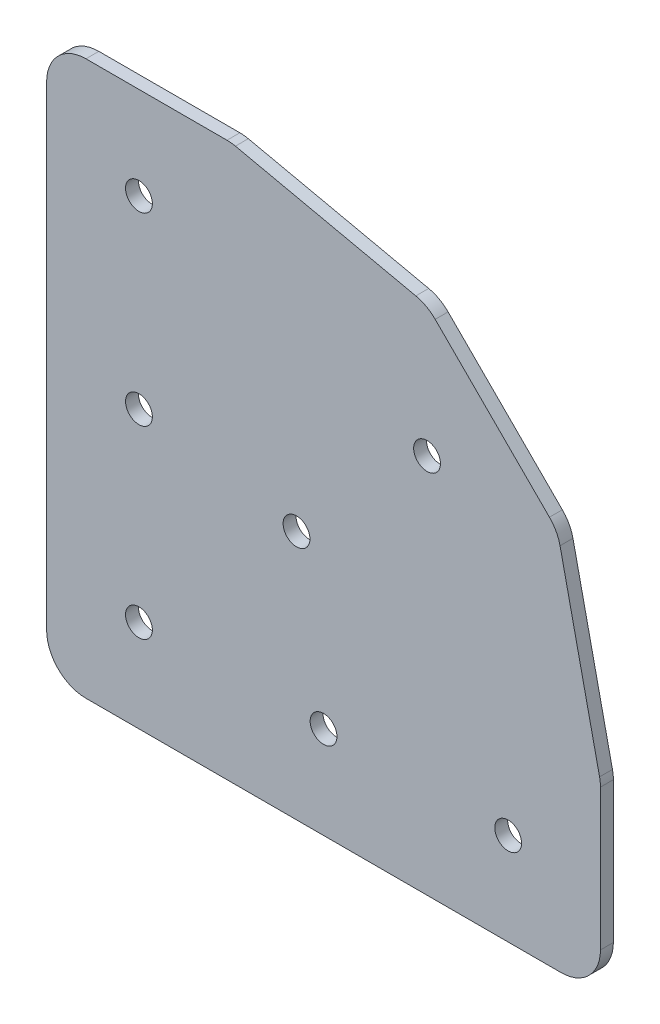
ISO-10303-21;
HEADER;
FILE_DESCRIPTION(('STEP AP214'),'2;1');
FILE_NAME('part.step','',(''),(''),'','','');
FILE_SCHEMA(('AUTOMOTIVE_DESIGN { 1 0 10303 214 1 1 1 1 }'));
ENDSEC;
DATA;
#1=APPLICATION_CONTEXT('core data for automotive mechanical design processes');
#2=APPLICATION_PROTOCOL_DEFINITION('international standard','automotive_design',2000,#1);
#3=PRODUCT_CONTEXT('',#1,'mechanical');
#4=PRODUCT('Part','Part','',(#3));
#5=PRODUCT_RELATED_PRODUCT_CATEGORY('part','',(#4));
#6=PRODUCT_DEFINITION_FORMATION('','',#4);
#7=PRODUCT_DEFINITION_CONTEXT('part definition',#1,'design');
#8=PRODUCT_DEFINITION('design','',#6,#7);
#9=PRODUCT_DEFINITION_SHAPE('','',#8);
#10=(LENGTH_UNIT() NAMED_UNIT(*) SI_UNIT(.MILLI.,.METRE.));
#11=(NAMED_UNIT(*) PLANE_ANGLE_UNIT() SI_UNIT($,.RADIAN.));
#12=(NAMED_UNIT(*) SI_UNIT($,.STERADIAN.) SOLID_ANGLE_UNIT());
#13=UNCERTAINTY_MEASURE_WITH_UNIT(LENGTH_MEASURE(1.E-05),#10,'distance_accuracy_value','');
#14=(GEOMETRIC_REPRESENTATION_CONTEXT(3) GLOBAL_UNCERTAINTY_ASSIGNED_CONTEXT((#13)) GLOBAL_UNIT_ASSIGNED_CONTEXT((#10,
#11,#12)) REPRESENTATION_CONTEXT('',''));
#15=CARTESIAN_POINT('',(0.,0.,0.));
#16=DIRECTION('',(0.,0.,1.));
#17=DIRECTION('',(1.,0.,0.));
#18=AXIS2_PLACEMENT_3D('',#15,#16,#17);
#19=CARTESIAN_POINT('',(0.,0.,1.5875));
#20=DIRECTION('',(0.,0.,1.));
#21=DIRECTION('',(1.,0.,0.));
#22=AXIS2_PLACEMENT_3D('',#19,#20,#21);
#23=PLANE('',#22);
#24=DIRECTION('',(0.,1.,0.));
#25=VECTOR('',#24,1.);
#26=CARTESIAN_POINT('',(0.,68.199,1.5875));
#27=LINE('',#26,#25);
#28=CARTESIAN_POINT('',(0.,63.357125,1.5875));
#29=VERTEX_POINT('',#28);
#30=CARTESIAN_POINT('',(0.,4.841875,1.5875));
#31=VERTEX_POINT('',#30);
#32=EDGE_CURVE('E151',#29,#31,#27,.F.);
#33=ORIENTED_EDGE('',*,*,#32,.T.);
#34=CARTESIAN_POINT('',(4.841875,4.841875,1.5875));
#35=DIRECTION('',(0.,0.,-1.));
#36=DIRECTION('',(-1.,0.,0.));
#37=AXIS2_PLACEMENT_3D('',#34,#35,#36);
#38=CIRCLE('',#37,4.841875);
#39=CARTESIAN_POINT('',(4.841875,0.,1.5875));
#40=VERTEX_POINT('',#39);
#41=EDGE_CURVE('E153',#40,#31,#38,.T.);
#42=ORIENTED_EDGE('',*,*,#41,.F.);
#43=DIRECTION('',(1.,0.,0.));
#44=VECTOR('',#43,1.);
#45=CARTESIAN_POINT('',(0.,0.,1.5875));
#46=LINE('',#45,#44);
#47=CARTESIAN_POINT('',(63.357125,0.,1.5875));
#48=VERTEX_POINT('',#47);
#49=EDGE_CURVE('E146',#40,#48,#46,.T.);
#50=ORIENTED_EDGE('',*,*,#49,.T.);
#51=CARTESIAN_POINT('',(63.357125,4.841875,1.5875));
#52=DIRECTION('',(0.,0.,-1.));
#53=DIRECTION('',(-1.,0.,0.));
#54=AXIS2_PLACEMENT_3D('',#51,#52,#53);
#55=CIRCLE('',#54,4.841875);
#56=CARTESIAN_POINT('',(68.199,4.841875,1.5875));
#57=VERTEX_POINT('',#56);
#58=EDGE_CURVE('E149',#57,#48,#55,.T.);
#59=ORIENTED_EDGE('',*,*,#58,.F.);
#60=DIRECTION('',(0.,1.,0.));
#61=VECTOR('',#60,1.);
#62=CARTESIAN_POINT('',(68.199,22.733,1.5875));
#63=LINE('',#62,#61);
#64=CARTESIAN_POINT('',(68.199,22.2091372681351,1.5875));
#65=VERTEX_POINT('',#64);
#66=EDGE_CURVE('E122',#57,#65,#63,.T.);
#67=ORIENTED_EDGE('',*,*,#66,.T.);
#68=CARTESIAN_POINT('',(63.357125,22.2091372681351,1.5875));
#69=DIRECTION('',(0.,0.,-1.));
#70=DIRECTION('',(-1.,0.,0.));
#71=AXIS2_PLACEMENT_3D('',#68,#69,#70);
#72=CIRCLE('',#71,4.841875);
#73=CARTESIAN_POINT('',(68.0869538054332,23.2447399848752,1.5875));
#74=VERTEX_POINT('',#73);
#75=EDGE_CURVE('E116',#74,#65,#72,.T.);
#76=ORIENTED_EDGE('',*,*,#75,.F.);
#77=DIRECTION('',(0.213884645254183,-0.976858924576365,0.));
#78=VECTOR('',#77,1.);
#79=CARTESIAN_POINT('',(62.9196461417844,46.8449876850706,1.5875));
#80=LINE('',#79,#78);
#81=CARTESIAN_POINT('',(63.2229671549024,45.4596529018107,1.5875));
#82=VERTEX_POINT('',#81);
#83=EDGE_CURVE('E120',#74,#82,#80,.F.);
#84=ORIENTED_EDGE('',*,*,#83,.T.);
#85=CARTESIAN_POINT('',(58.4931383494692,44.4240501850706,1.5875));
#86=DIRECTION('',(0.,0.,-1.));
#87=DIRECTION('',(-1.,0.,0.));
#88=AXIS2_PLACEMENT_3D('',#85,#86,#87);
#89=CIRCLE('',#88,4.841875);
#90=CARTESIAN_POINT('',(61.9168609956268,47.8477728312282,1.5875));
#91=VERTEX_POINT('',#90);
#92=EDGE_CURVE('E135',#91,#82,#89,.T.);
#93=ORIENTED_EDGE('',*,*,#92,.F.);
#94=DIRECTION('',(0.707106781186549,-0.707106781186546,0.));
#95=VECTOR('',#94,1.);
#96=CARTESIAN_POINT('',(62.9196461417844,46.8449876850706,1.5875));
#97=LINE('',#96,#95);
#98=CARTESIAN_POINT('',(47.8477728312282,61.9168609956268,1.5875));
#99=VERTEX_POINT('',#98);
#100=EDGE_CURVE('E165',#91,#99,#97,.F.);
#101=ORIENTED_EDGE('',*,*,#100,.T.);
#102=CARTESIAN_POINT('',(44.4240501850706,58.4931383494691,1.5875));
#103=DIRECTION('',(0.,0.,-1.));
#104=DIRECTION('',(-1.,0.,0.));
#105=AXIS2_PLACEMENT_3D('',#102,#103,#104);
#106=CIRCLE('',#105,4.841875);
#107=CARTESIAN_POINT('',(45.4596529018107,63.2229671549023,1.5875));
#108=VERTEX_POINT('',#107);
#109=EDGE_CURVE('E167',#108,#99,#106,.T.);
#110=ORIENTED_EDGE('',*,*,#109,.F.);
#111=DIRECTION('',(0.976858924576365,-0.213884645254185,0.));
#112=VECTOR('',#111,1.);
#113=CARTESIAN_POINT('',(46.8449876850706,62.9196461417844,1.5875));
#114=LINE('',#113,#112);
#115=CARTESIAN_POINT('',(23.2447399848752,68.0869538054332,1.5875));
#116=VERTEX_POINT('',#115);
#117=EDGE_CURVE('E160',#108,#116,#114,.F.);
#118=ORIENTED_EDGE('',*,*,#117,.T.);
#119=CARTESIAN_POINT('',(22.2091372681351,63.357125,1.5875));
#120=DIRECTION('',(0.,0.,-1.));
#121=DIRECTION('',(-1.,0.,0.));
#122=AXIS2_PLACEMENT_3D('',#119,#120,#121);
#123=CIRCLE('',#122,4.841875);
#124=CARTESIAN_POINT('',(22.2091372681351,68.199,1.5875));
#125=VERTEX_POINT('',#124);
#126=EDGE_CURVE('E163',#125,#116,#123,.T.);
#127=ORIENTED_EDGE('',*,*,#126,.F.);
#128=DIRECTION('',(1.,0.,0.));
#129=VECTOR('',#128,1.);
#130=CARTESIAN_POINT('',(22.733,68.199,1.5875));
#131=LINE('',#130,#129);
#132=CARTESIAN_POINT('',(4.841875,68.199,1.5875));
#133=VERTEX_POINT('',#132);
#134=EDGE_CURVE('E155',#125,#133,#131,.F.);
#135=ORIENTED_EDGE('',*,*,#134,.T.);
#136=CARTESIAN_POINT('',(4.841875,63.357125,1.5875));
#137=DIRECTION('',(0.,0.,-1.));
#138=DIRECTION('',(-1.,0.,0.));
#139=AXIS2_PLACEMENT_3D('',#136,#137,#138);
#140=CIRCLE('',#139,4.841875);
#141=EDGE_CURVE('E158',#29,#133,#140,.T.);
#142=ORIENTED_EDGE('',*,*,#141,.F.);
#143=EDGE_LOOP('',(#33,#42,#50,#59,#67,#76,#84,#93,#101,#110,#118,#127,#135,#142));
#144=FACE_BOUND('',#143,.T.);
#145=CARTESIAN_POINT('',(11.3665,56.8325,1.5875));
#146=DIRECTION('',(0.,0.,1.));
#147=DIRECTION('',(1.,0.,0.));
#148=AXIS2_PLACEMENT_3D('',#145,#146,#147);
#149=CIRCLE('',#148,1.651);
#150=CARTESIAN_POINT('',(13.0175,56.8325,1.5875));
#151=VERTEX_POINT('',#150);
#152=EDGE_CURVE('E128',#151,#151,#149,.F.);
#153=ORIENTED_EDGE('',*,*,#152,.T.);
#154=EDGE_LOOP('',(#153));
#155=FACE_BOUND('',#154,.T.);
#156=CARTESIAN_POINT('',(11.3665,34.0995,1.5875));
#157=DIRECTION('',(0.,0.,1.));
#158=DIRECTION('',(1.,0.,0.));
#159=AXIS2_PLACEMENT_3D('',#156,#157,#158);
#160=CIRCLE('',#159,1.651);
#161=CARTESIAN_POINT('',(13.0175,34.0995,1.5875));
#162=VERTEX_POINT('',#161);
#163=EDGE_CURVE('E227',#162,#162,#160,.F.);
#164=ORIENTED_EDGE('',*,*,#163,.T.);
#165=EDGE_LOOP('',(#164));
#166=FACE_BOUND('',#165,.T.);
#167=CARTESIAN_POINT('',(11.3665,11.3665,1.5875));
#168=DIRECTION('',(0.,0.,1.));
#169=DIRECTION('',(1.,0.,0.));
#170=AXIS2_PLACEMENT_3D('',#167,#168,#169);
#171=CIRCLE('',#170,1.651);
#172=CARTESIAN_POINT('',(13.0175,11.3665,1.5875));
#173=VERTEX_POINT('',#172);
#174=EDGE_CURVE('E230',#173,#173,#171,.F.);
#175=ORIENTED_EDGE('',*,*,#174,.T.);
#176=EDGE_LOOP('',(#175));
#177=FACE_BOUND('',#176,.T.);
#178=CARTESIAN_POINT('',(56.8325,11.3665,1.5875));
#179=DIRECTION('',(0.,0.,1.));
#180=DIRECTION('',(1.,0.,0.));
#181=AXIS2_PLACEMENT_3D('',#178,#179,#180);
#182=CIRCLE('',#181,1.651);
#183=CARTESIAN_POINT('',(58.4835,11.3665,1.5875));
#184=VERTEX_POINT('',#183);
#185=EDGE_CURVE('E233',#184,#184,#182,.F.);
#186=ORIENTED_EDGE('',*,*,#185,.T.);
#187=EDGE_LOOP('',(#186));
#188=FACE_BOUND('',#187,.T.);
#189=CARTESIAN_POINT('',(30.7703292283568,30.7703292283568,1.5875));
#190=DIRECTION('',(0.,0.,1.));
#191=DIRECTION('',(1.,0.,0.));
#192=AXIS2_PLACEMENT_3D('',#189,#190,#191);
#193=CIRCLE('',#192,1.651);
#194=CARTESIAN_POINT('',(32.4213292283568,30.7703292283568,1.5875));
#195=VERTEX_POINT('',#194);
#196=EDGE_CURVE('E236',#195,#195,#193,.F.);
#197=ORIENTED_EDGE('',*,*,#196,.T.);
#198=EDGE_LOOP('',(#197));
#199=FACE_BOUND('',#198,.T.);
#200=CARTESIAN_POINT('',(46.8449876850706,46.8449876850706,1.5875));
#201=DIRECTION('',(0.,0.,1.));
#202=DIRECTION('',(1.,0.,0.));
#203=AXIS2_PLACEMENT_3D('',#200,#201,#202);
#204=CIRCLE('',#203,1.651);
#205=CARTESIAN_POINT('',(48.4959876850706,46.8449876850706,1.5875));
#206=VERTEX_POINT('',#205);
#207=EDGE_CURVE('E238',#206,#206,#204,.F.);
#208=ORIENTED_EDGE('',*,*,#207,.T.);
#209=EDGE_LOOP('',(#208));
#210=FACE_BOUND('',#209,.T.);
#211=CARTESIAN_POINT('',(34.0995,11.3665,1.5875));
#212=DIRECTION('',(0.,0.,1.));
#213=DIRECTION('',(1.,0.,0.));
#214=AXIS2_PLACEMENT_3D('',#211,#212,#213);
#215=CIRCLE('',#214,1.651);
#216=CARTESIAN_POINT('',(35.7505,11.3665,1.5875));
#217=VERTEX_POINT('',#216);
#218=EDGE_CURVE('E20',#217,#217,#215,.F.);
#219=ORIENTED_EDGE('',*,*,#218,.T.);
#220=EDGE_LOOP('',(#219));
#221=FACE_BOUND('',#220,.T.);
#222=ADVANCED_FACE('F17',(#144,#155,#166,#177,#188,#199,#210,#221),#23,.T.);
#223=CARTESIAN_POINT('',(34.0995,11.3665,1.5875));
#224=DIRECTION('',(0.,0.,1.));
#225=DIRECTION('',(1.,0.,0.));
#226=AXIS2_PLACEMENT_3D('',#223,#224,#225);
#227=CYLINDRICAL_SURFACE('',#226,1.651);
#228=CARTESIAN_POINT('',(34.0995,11.3665,0.));
#229=DIRECTION('',(0.,0.,1.));
#230=DIRECTION('',(1.,0.,0.));
#231=AXIS2_PLACEMENT_3D('',#228,#229,#230);
#232=CIRCLE('',#231,1.651);
#233=CARTESIAN_POINT('',(35.7505,11.3665,0.));
#234=VERTEX_POINT('',#233);
#235=EDGE_CURVE('E145',#234,#234,#232,.F.);
#236=ORIENTED_EDGE('',*,*,#235,.T.);
#237=EDGE_LOOP('',(#236));
#238=FACE_BOUND('',#237,.T.);
#239=ORIENTED_EDGE('',*,*,#218,.F.);
#240=EDGE_LOOP('',(#239));
#241=FACE_BOUND('',#240,.T.);
#242=ADVANCED_FACE('F246',(#238,#241),#227,.F.);
#243=CARTESIAN_POINT('',(46.8449876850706,46.8449876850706,1.5875));
#244=DIRECTION('',(0.,0.,1.));
#245=DIRECTION('',(1.,0.,0.));
#246=AXIS2_PLACEMENT_3D('',#243,#244,#245);
#247=CYLINDRICAL_SURFACE('',#246,1.651);
#248=CARTESIAN_POINT('',(46.8449876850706,46.8449876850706,0.));
#249=DIRECTION('',(0.,0.,1.));
#250=DIRECTION('',(1.,0.,0.));
#251=AXIS2_PLACEMENT_3D('',#248,#249,#250);
#252=CIRCLE('',#251,1.651);
#253=CARTESIAN_POINT('',(48.4959876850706,46.8449876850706,0.));
#254=VERTEX_POINT('',#253);
#255=EDGE_CURVE('E209',#254,#254,#252,.F.);
#256=ORIENTED_EDGE('',*,*,#255,.T.);
#257=EDGE_LOOP('',(#256));
#258=FACE_BOUND('',#257,.T.);
#259=ORIENTED_EDGE('',*,*,#207,.F.);
#260=EDGE_LOOP('',(#259));
#261=FACE_BOUND('',#260,.T.);
#262=ADVANCED_FACE('F248',(#258,#261),#247,.F.);
#263=CARTESIAN_POINT('',(30.7703292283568,30.7703292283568,1.5875));
#264=DIRECTION('',(0.,0.,1.));
#265=DIRECTION('',(1.,0.,0.));
#266=AXIS2_PLACEMENT_3D('',#263,#264,#265);
#267=CYLINDRICAL_SURFACE('',#266,1.651);
#268=CARTESIAN_POINT('',(30.7703292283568,30.7703292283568,0.));
#269=DIRECTION('',(0.,0.,1.));
#270=DIRECTION('',(1.,0.,0.));
#271=AXIS2_PLACEMENT_3D('',#268,#269,#270);
#272=CIRCLE('',#271,1.651);
#273=CARTESIAN_POINT('',(32.4213292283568,30.7703292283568,0.));
#274=VERTEX_POINT('',#273);
#275=EDGE_CURVE('E206',#274,#274,#272,.F.);
#276=ORIENTED_EDGE('',*,*,#275,.T.);
#277=EDGE_LOOP('',(#276));
#278=FACE_BOUND('',#277,.T.);
#279=ORIENTED_EDGE('',*,*,#196,.F.);
#280=EDGE_LOOP('',(#279));
#281=FACE_BOUND('',#280,.T.);
#282=ADVANCED_FACE('F255',(#278,#281),#267,.F.);
#283=CARTESIAN_POINT('',(56.8325,11.3665,1.5875));
#284=DIRECTION('',(0.,0.,1.));
#285=DIRECTION('',(1.,0.,0.));
#286=AXIS2_PLACEMENT_3D('',#283,#284,#285);
#287=CYLINDRICAL_SURFACE('',#286,1.651);
#288=CARTESIAN_POINT('',(56.8325,11.3665,0.));
#289=DIRECTION('',(0.,0.,1.));
#290=DIRECTION('',(1.,0.,0.));
#291=AXIS2_PLACEMENT_3D('',#288,#289,#290);
#292=CIRCLE('',#291,1.651);
#293=CARTESIAN_POINT('',(58.4835,11.3665,0.));
#294=VERTEX_POINT('',#293);
#295=EDGE_CURVE('E203',#294,#294,#292,.F.);
#296=ORIENTED_EDGE('',*,*,#295,.T.);
#297=EDGE_LOOP('',(#296));
#298=FACE_BOUND('',#297,.T.);
#299=ORIENTED_EDGE('',*,*,#185,.F.);
#300=EDGE_LOOP('',(#299));
#301=FACE_BOUND('',#300,.T.);
#302=ADVANCED_FACE('F329',(#298,#301),#287,.F.);
#303=CARTESIAN_POINT('',(11.3665,11.3665,1.5875));
#304=DIRECTION('',(0.,0.,1.));
#305=DIRECTION('',(1.,0.,0.));
#306=AXIS2_PLACEMENT_3D('',#303,#304,#305);
#307=CYLINDRICAL_SURFACE('',#306,1.651);
#308=CARTESIAN_POINT('',(11.3665,11.3665,0.));
#309=DIRECTION('',(0.,0.,1.));
#310=DIRECTION('',(1.,0.,0.));
#311=AXIS2_PLACEMENT_3D('',#308,#309,#310);
#312=CIRCLE('',#311,1.651);
#313=CARTESIAN_POINT('',(13.0175,11.3665,0.));
#314=VERTEX_POINT('',#313);
#315=EDGE_CURVE('E200',#314,#314,#312,.F.);
#316=ORIENTED_EDGE('',*,*,#315,.T.);
#317=EDGE_LOOP('',(#316));
#318=FACE_BOUND('',#317,.T.);
#319=ORIENTED_EDGE('',*,*,#174,.F.);
#320=EDGE_LOOP('',(#319));
#321=FACE_BOUND('',#320,.T.);
#322=ADVANCED_FACE('F325',(#318,#321),#307,.F.);
#323=CARTESIAN_POINT('',(11.3665,34.0995,1.5875));
#324=DIRECTION('',(0.,0.,1.));
#325=DIRECTION('',(1.,0.,0.));
#326=AXIS2_PLACEMENT_3D('',#323,#324,#325);
#327=CYLINDRICAL_SURFACE('',#326,1.651);
#328=CARTESIAN_POINT('',(11.3665,34.0995,0.));
#329=DIRECTION('',(0.,0.,1.));
#330=DIRECTION('',(1.,0.,0.));
#331=AXIS2_PLACEMENT_3D('',#328,#329,#330);
#332=CIRCLE('',#331,1.651);
#333=CARTESIAN_POINT('',(13.0175,34.0995,0.));
#334=VERTEX_POINT('',#333);
#335=EDGE_CURVE('E197',#334,#334,#332,.F.);
#336=ORIENTED_EDGE('',*,*,#335,.T.);
#337=EDGE_LOOP('',(#336));
#338=FACE_BOUND('',#337,.T.);
#339=ORIENTED_EDGE('',*,*,#163,.F.);
#340=EDGE_LOOP('',(#339));
#341=FACE_BOUND('',#340,.T.);
#342=ADVANCED_FACE('F321',(#338,#341),#327,.F.);
#343=CARTESIAN_POINT('',(11.3665,56.8325,1.5875));
#344=DIRECTION('',(0.,0.,1.));
#345=DIRECTION('',(1.,0.,0.));
#346=AXIS2_PLACEMENT_3D('',#343,#344,#345);
#347=CYLINDRICAL_SURFACE('',#346,1.651);
#348=CARTESIAN_POINT('',(11.3665,56.8325,0.));
#349=DIRECTION('',(0.,0.,1.));
#350=DIRECTION('',(1.,0.,0.));
#351=AXIS2_PLACEMENT_3D('',#348,#349,#350);
#352=CIRCLE('',#351,1.651);
#353=CARTESIAN_POINT('',(13.0175,56.8325,0.));
#354=VERTEX_POINT('',#353);
#355=EDGE_CURVE('E194',#354,#354,#352,.F.);
#356=ORIENTED_EDGE('',*,*,#355,.T.);
#357=EDGE_LOOP('',(#356));
#358=FACE_BOUND('',#357,.T.);
#359=ORIENTED_EDGE('',*,*,#152,.F.);
#360=EDGE_LOOP('',(#359));
#361=FACE_BOUND('',#360,.T.);
#362=ADVANCED_FACE('F318',(#358,#361),#347,.F.);
#363=CARTESIAN_POINT('',(63.357125,22.2091372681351,1.5875));
#364=DIRECTION('',(0.,0.,-1.));
#365=DIRECTION('',(-1.,0.,0.));
#366=AXIS2_PLACEMENT_3D('',#363,#364,#365);
#367=CYLINDRICAL_SURFACE('',#366,4.841875);
#368=CARTESIAN_POINT('',(63.357125,22.2091372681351,0.));
#369=DIRECTION('',(0.,0.,-1.));
#370=DIRECTION('',(-1.,0.,0.));
#371=AXIS2_PLACEMENT_3D('',#368,#369,#370);
#372=CIRCLE('',#371,4.841875);
#373=CARTESIAN_POINT('',(68.199,22.2091372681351,0.));
#374=VERTEX_POINT('',#373);
#375=CARTESIAN_POINT('',(68.0869538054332,23.2447399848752,0.));
#376=VERTEX_POINT('',#375);
#377=EDGE_CURVE('E139',#374,#376,#372,.F.);
#378=ORIENTED_EDGE('',*,*,#377,.T.);
#379=DIRECTION('',(0.,0.,1.));
#380=VECTOR('',#379,1.);
#381=CARTESIAN_POINT('',(68.0869538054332,23.2447399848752,1.5875));
#382=LINE('',#381,#380);
#383=EDGE_CURVE('E127',#376,#74,#382,.T.);
#384=ORIENTED_EDGE('',*,*,#383,.T.);
#385=ORIENTED_EDGE('',*,*,#75,.T.);
#386=DIRECTION('',(0.,0.,1.));
#387=VECTOR('',#386,1.);
#388=CARTESIAN_POINT('',(68.199,22.2091372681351,1.5875));
#389=LINE('',#388,#387);
#390=EDGE_CURVE('E525',#65,#374,#389,.F.);
#391=ORIENTED_EDGE('',*,*,#390,.T.);
#392=EDGE_LOOP('',(#378,#384,#385,#391));
#393=FACE_BOUND('',#392,.T.);
#394=ADVANCED_FACE('F138',(#393),#367,.T.);
#395=CARTESIAN_POINT('',(62.9196461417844,46.8449876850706,1.5875));
#396=DIRECTION('',(-0.976858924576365,-0.213884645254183,0.));
#397=DIRECTION('',(0.213884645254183,-0.976858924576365,0.));
#398=AXIS2_PLACEMENT_3D('',#395,#396,#397);
#399=PLANE('',#398);
#400=ORIENTED_EDGE('',*,*,#383,.F.);
#401=DIRECTION('',(-0.213884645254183,0.976858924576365,0.));
#402=VECTOR('',#401,1.);
#403=CARTESIAN_POINT('',(68.0869538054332,23.2447399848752,0.));
#404=LINE('',#403,#402);
#405=CARTESIAN_POINT('',(63.2229671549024,45.4596529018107,0.));
#406=VERTEX_POINT('',#405);
#407=EDGE_CURVE('E192',#376,#406,#404,.T.);
#408=ORIENTED_EDGE('',*,*,#407,.T.);
#409=DIRECTION('',(0.,0.,-1.));
#410=VECTOR('',#409,1.);
#411=CARTESIAN_POINT('',(63.2229671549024,45.4596529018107,1.5875));
#412=LINE('',#411,#410);
#413=EDGE_CURVE('E134',#82,#406,#412,.T.);
#414=ORIENTED_EDGE('',*,*,#413,.F.);
#415=ORIENTED_EDGE('',*,*,#83,.F.);
#416=EDGE_LOOP('',(#400,#408,#414,#415));
#417=FACE_BOUND('',#416,.T.);
#418=ADVANCED_FACE('F131',(#417),#399,.F.);
#419=CARTESIAN_POINT('',(58.4931383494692,44.4240501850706,1.5875));
#420=DIRECTION('',(0.,0.,-1.));
#421=DIRECTION('',(-1.,0.,0.));
#422=AXIS2_PLACEMENT_3D('',#419,#420,#421);
#423=CYLINDRICAL_SURFACE('',#422,4.841875);
#424=CARTESIAN_POINT('',(58.4931383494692,44.4240501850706,0.));
#425=DIRECTION('',(0.,0.,-1.));
#426=DIRECTION('',(-1.,0.,0.));
#427=AXIS2_PLACEMENT_3D('',#424,#425,#426);
#428=CIRCLE('',#427,4.841875);
#429=CARTESIAN_POINT('',(61.9168609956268,47.8477728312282,0.));
#430=VERTEX_POINT('',#429);
#431=EDGE_CURVE('E189',#406,#430,#428,.F.);
#432=ORIENTED_EDGE('',*,*,#431,.T.);
#433=DIRECTION('',(0.,0.,1.));
#434=VECTOR('',#433,1.);
#435=CARTESIAN_POINT('',(61.9168609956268,47.8477728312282,1.5875));
#436=LINE('',#435,#434);
#437=EDGE_CURVE('E168',#430,#91,#436,.T.);
#438=ORIENTED_EDGE('',*,*,#437,.T.);
#439=ORIENTED_EDGE('',*,*,#92,.T.);
#440=ORIENTED_EDGE('',*,*,#413,.T.);
#441=EDGE_LOOP('',(#432,#438,#439,#440));
#442=FACE_BOUND('',#441,.T.);
#443=ADVANCED_FACE('F309',(#442),#423,.T.);
#444=CARTESIAN_POINT('',(62.9196461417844,46.8449876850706,1.5875));
#445=DIRECTION('',(-0.707106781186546,-0.707106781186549,0.));
#446=DIRECTION('',(0.707106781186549,-0.707106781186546,0.));
#447=AXIS2_PLACEMENT_3D('',#444,#445,#446);
#448=PLANE('',#447);
#449=ORIENTED_EDGE('',*,*,#437,.F.);
#450=DIRECTION('',(-0.707106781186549,0.707106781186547,0.));
#451=VECTOR('',#450,1.);
#452=CARTESIAN_POINT('',(61.9168609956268,47.8477728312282,0.));
#453=LINE('',#452,#451);
#454=CARTESIAN_POINT('',(47.8477728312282,61.9168609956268,0.));
#455=VERTEX_POINT('',#454);
#456=EDGE_CURVE('E188',#430,#455,#453,.T.);
#457=ORIENTED_EDGE('',*,*,#456,.T.);
#458=DIRECTION('',(0.,0.,-1.));
#459=VECTOR('',#458,1.);
#460=CARTESIAN_POINT('',(47.8477728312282,61.9168609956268,1.5875));
#461=LINE('',#460,#459);
#462=EDGE_CURVE('E223',#99,#455,#461,.T.);
#463=ORIENTED_EDGE('',*,*,#462,.F.);
#464=ORIENTED_EDGE('',*,*,#100,.F.);
#465=EDGE_LOOP('',(#449,#457,#463,#464));
#466=FACE_BOUND('',#465,.T.);
#467=ADVANCED_FACE('F305',(#466),#448,.F.);
#468=CARTESIAN_POINT('',(44.4240501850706,58.4931383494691,1.5875));
#469=DIRECTION('',(0.,0.,-1.));
#470=DIRECTION('',(-1.,0.,0.));
#471=AXIS2_PLACEMENT_3D('',#468,#469,#470);
#472=CYLINDRICAL_SURFACE('',#471,4.841875);
#473=CARTESIAN_POINT('',(44.4240501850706,58.4931383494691,0.));
#474=DIRECTION('',(0.,0.,-1.));
#475=DIRECTION('',(-1.,0.,0.));
#476=AXIS2_PLACEMENT_3D('',#473,#474,#475);
#477=CIRCLE('',#476,4.841875);
#478=CARTESIAN_POINT('',(45.4596529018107,63.2229671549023,0.));
#479=VERTEX_POINT('',#478);
#480=EDGE_CURVE('E185',#455,#479,#477,.F.);
#481=ORIENTED_EDGE('',*,*,#480,.T.);
#482=DIRECTION('',(0.,0.,1.));
#483=VECTOR('',#482,1.);
#484=CARTESIAN_POINT('',(45.4596529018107,63.2229671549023,1.5875));
#485=LINE('',#484,#483);
#486=EDGE_CURVE('E164',#479,#108,#485,.T.);
#487=ORIENTED_EDGE('',*,*,#486,.T.);
#488=ORIENTED_EDGE('',*,*,#109,.T.);
#489=ORIENTED_EDGE('',*,*,#462,.T.);
#490=EDGE_LOOP('',(#481,#487,#488,#489));
#491=FACE_BOUND('',#490,.T.);
#492=ADVANCED_FACE('F301',(#491),#472,.T.);
#493=CARTESIAN_POINT('',(46.8449876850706,62.9196461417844,1.5875));
#494=DIRECTION('',(-0.213884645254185,-0.976858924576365,0.));
#495=DIRECTION('',(0.976858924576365,-0.213884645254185,0.));
#496=AXIS2_PLACEMENT_3D('',#493,#494,#495);
#497=PLANE('',#496);
#498=ORIENTED_EDGE('',*,*,#486,.F.);
#499=DIRECTION('',(-0.976858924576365,0.213884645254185,0.));
#500=VECTOR('',#499,1.);
#501=CARTESIAN_POINT('',(45.4596529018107,63.2229671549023,0.));
#502=LINE('',#501,#500);
#503=CARTESIAN_POINT('',(23.2447399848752,68.0869538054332,0.));
#504=VERTEX_POINT('',#503);
#505=EDGE_CURVE('E184',#479,#504,#502,.T.);
#506=ORIENTED_EDGE('',*,*,#505,.T.);
#507=DIRECTION('',(0.,0.,-1.));
#508=VECTOR('',#507,1.);
#509=CARTESIAN_POINT('',(23.2447399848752,68.0869538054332,1.5875));
#510=LINE('',#509,#508);
#511=EDGE_CURVE('E221',#116,#504,#510,.T.);
#512=ORIENTED_EDGE('',*,*,#511,.F.);
#513=ORIENTED_EDGE('',*,*,#117,.F.);
#514=EDGE_LOOP('',(#498,#506,#512,#513));
#515=FACE_BOUND('',#514,.T.);
#516=ADVANCED_FACE('F297',(#515),#497,.F.);
#517=CARTESIAN_POINT('',(22.2091372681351,63.357125,1.5875));
#518=DIRECTION('',(0.,0.,-1.));
#519=DIRECTION('',(-1.,0.,0.));
#520=AXIS2_PLACEMENT_3D('',#517,#518,#519);
#521=CYLINDRICAL_SURFACE('',#520,4.841875);
#522=CARTESIAN_POINT('',(22.2091372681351,63.357125,0.));
#523=DIRECTION('',(0.,0.,-1.));
#524=DIRECTION('',(-1.,0.,0.));
#525=AXIS2_PLACEMENT_3D('',#522,#523,#524);
#526=CIRCLE('',#525,4.841875);
#527=CARTESIAN_POINT('',(22.2091372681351,68.199,0.));
#528=VERTEX_POINT('',#527);
#529=EDGE_CURVE('E181',#504,#528,#526,.F.);
#530=ORIENTED_EDGE('',*,*,#529,.T.);
#531=DIRECTION('',(0.,0.,-1.));
#532=VECTOR('',#531,1.);
#533=CARTESIAN_POINT('',(22.2091372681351,68.199,1.5875));
#534=LINE('',#533,#532);
#535=EDGE_CURVE('E159',#528,#125,#534,.F.);
#536=ORIENTED_EDGE('',*,*,#535,.T.);
#537=ORIENTED_EDGE('',*,*,#126,.T.);
#538=ORIENTED_EDGE('',*,*,#511,.T.);
#539=EDGE_LOOP('',(#530,#536,#537,#538));
#540=FACE_BOUND('',#539,.T.);
#541=ADVANCED_FACE('F293',(#540),#521,.T.);
#542=CARTESIAN_POINT('',(22.733,68.199,1.5875));
#543=DIRECTION('',(0.,-1.,0.));
#544=DIRECTION('',(0.,0.,-1.));
#545=AXIS2_PLACEMENT_3D('',#542,#543,#544);
#546=PLANE('',#545);
#547=ORIENTED_EDGE('',*,*,#535,.F.);
#548=DIRECTION('',(1.,0.,0.));
#549=VECTOR('',#548,1.);
#550=CARTESIAN_POINT('',(0.,68.199,0.));
#551=LINE('',#550,#549);
#552=CARTESIAN_POINT('',(4.841875,68.199,0.));
#553=VERTEX_POINT('',#552);
#554=EDGE_CURVE('E180',#528,#553,#551,.F.);
#555=ORIENTED_EDGE('',*,*,#554,.T.);
#556=DIRECTION('',(0.,0.,-1.));
#557=VECTOR('',#556,1.);
#558=CARTESIAN_POINT('',(4.841875,68.199,1.5875));
#559=LINE('',#558,#557);
#560=EDGE_CURVE('E219',#133,#553,#559,.T.);
#561=ORIENTED_EDGE('',*,*,#560,.F.);
#562=ORIENTED_EDGE('',*,*,#134,.F.);
#563=EDGE_LOOP('',(#547,#555,#561,#562));
#564=FACE_BOUND('',#563,.T.);
#565=ADVANCED_FACE('F289',(#564),#546,.F.);
#566=CARTESIAN_POINT('',(4.841875,63.357125,1.5875));
#567=DIRECTION('',(0.,0.,-1.));
#568=DIRECTION('',(-1.,0.,0.));
#569=AXIS2_PLACEMENT_3D('',#566,#567,#568);
#570=CYLINDRICAL_SURFACE('',#569,4.841875);
#571=CARTESIAN_POINT('',(4.841875,63.357125,0.));
#572=DIRECTION('',(0.,0.,-1.));
#573=DIRECTION('',(-1.,0.,0.));
#574=AXIS2_PLACEMENT_3D('',#571,#572,#573);
#575=CIRCLE('',#574,4.841875);
#576=CARTESIAN_POINT('',(0.,63.357125,0.));
#577=VERTEX_POINT('',#576);
#578=EDGE_CURVE('E177',#553,#577,#575,.F.);
#579=ORIENTED_EDGE('',*,*,#578,.T.);
#580=DIRECTION('',(0.,0.,-1.));
#581=VECTOR('',#580,1.);
#582=CARTESIAN_POINT('',(0.,63.357125,1.5875));
#583=LINE('',#582,#581);
#584=EDGE_CURVE('E154',#577,#29,#583,.F.);
#585=ORIENTED_EDGE('',*,*,#584,.T.);
#586=ORIENTED_EDGE('',*,*,#141,.T.);
#587=ORIENTED_EDGE('',*,*,#560,.T.);
#588=EDGE_LOOP('',(#579,#585,#586,#587));
#589=FACE_BOUND('',#588,.T.);
#590=ADVANCED_FACE('F285',(#589),#570,.T.);
#591=CARTESIAN_POINT('',(0.,68.199,1.5875));
#592=DIRECTION('',(1.,0.,0.));
#593=DIRECTION('',(0.,0.,-1.));
#594=AXIS2_PLACEMENT_3D('',#591,#592,#593);
#595=PLANE('',#594);
#596=DIRECTION('',(0.,0.,-1.));
#597=VECTOR('',#596,1.);
#598=CARTESIAN_POINT('',(0.,4.841875,1.5875));
#599=LINE('',#598,#597);
#600=CARTESIAN_POINT('',(0.,4.841875,0.));
#601=VERTEX_POINT('',#600);
#602=EDGE_CURVE('E217',#31,#601,#599,.T.);
#603=ORIENTED_EDGE('',*,*,#602,.F.);
#604=ORIENTED_EDGE('',*,*,#32,.F.);
#605=ORIENTED_EDGE('',*,*,#584,.F.);
#606=DIRECTION('',(0.,1.,0.));
#607=VECTOR('',#606,1.);
#608=CARTESIAN_POINT('',(0.,0.,0.));
#609=LINE('',#608,#607);
#610=EDGE_CURVE('E176',#577,#601,#609,.F.);
#611=ORIENTED_EDGE('',*,*,#610,.T.);
#612=EDGE_LOOP('',(#603,#604,#605,#611));
#613=FACE_BOUND('',#612,.T.);
#614=ADVANCED_FACE('F281',(#613),#595,.F.);
#615=CARTESIAN_POINT('',(4.841875,4.841875,1.5875));
#616=DIRECTION('',(0.,0.,-1.));
#617=DIRECTION('',(-1.,0.,0.));
#618=AXIS2_PLACEMENT_3D('',#615,#616,#617);
#619=CYLINDRICAL_SURFACE('',#618,4.841875);
#620=CARTESIAN_POINT('',(4.841875,4.841875,0.));
#621=DIRECTION('',(0.,0.,-1.));
#622=DIRECTION('',(-1.,0.,0.));
#623=AXIS2_PLACEMENT_3D('',#620,#621,#622);
#624=CIRCLE('',#623,4.841875);
#625=CARTESIAN_POINT('',(4.841875,0.,0.));
#626=VERTEX_POINT('',#625);
#627=EDGE_CURVE('E173',#601,#626,#624,.F.);
#628=ORIENTED_EDGE('',*,*,#627,.T.);
#629=DIRECTION('',(0.,0.,1.));
#630=VECTOR('',#629,1.);
#631=CARTESIAN_POINT('',(4.841875,0.,1.5875));
#632=LINE('',#631,#630);
#633=EDGE_CURVE('E150',#626,#40,#632,.T.);
#634=ORIENTED_EDGE('',*,*,#633,.T.);
#635=ORIENTED_EDGE('',*,*,#41,.T.);
#636=ORIENTED_EDGE('',*,*,#602,.T.);
#637=EDGE_LOOP('',(#628,#634,#635,#636));
#638=FACE_BOUND('',#637,.T.);
#639=ADVANCED_FACE('F277',(#638),#619,.T.);
#640=CARTESIAN_POINT('',(0.,0.,1.5875));
#641=DIRECTION('',(0.,1.,0.));
#642=DIRECTION('',(0.,0.,1.));
#643=AXIS2_PLACEMENT_3D('',#640,#641,#642);
#644=PLANE('',#643);
#645=DIRECTION('',(0.,0.,-1.));
#646=VECTOR('',#645,1.);
#647=CARTESIAN_POINT('',(63.357125,0.,1.5875));
#648=LINE('',#647,#646);
#649=CARTESIAN_POINT('',(63.357125,0.,0.));
#650=VERTEX_POINT('',#649);
#651=EDGE_CURVE('E215',#48,#650,#648,.T.);
#652=ORIENTED_EDGE('',*,*,#651,.F.);
#653=ORIENTED_EDGE('',*,*,#49,.F.);
#654=ORIENTED_EDGE('',*,*,#633,.F.);
#655=DIRECTION('',(1.,0.,0.));
#656=VECTOR('',#655,1.);
#657=CARTESIAN_POINT('',(0.,0.,0.));
#658=LINE('',#657,#656);
#659=EDGE_CURVE('E172',#626,#650,#658,.T.);
#660=ORIENTED_EDGE('',*,*,#659,.T.);
#661=EDGE_LOOP('',(#652,#653,#654,#660));
#662=FACE_BOUND('',#661,.T.);
#663=ADVANCED_FACE('F273',(#662),#644,.F.);
#664=CARTESIAN_POINT('',(63.357125,4.841875,1.5875));
#665=DIRECTION('',(0.,0.,-1.));
#666=DIRECTION('',(-1.,0.,0.));
#667=AXIS2_PLACEMENT_3D('',#664,#665,#666);
#668=CYLINDRICAL_SURFACE('',#667,4.841875);
#669=CARTESIAN_POINT('',(63.357125,4.841875,0.));
#670=DIRECTION('',(0.,0.,-1.));
#671=DIRECTION('',(-1.,0.,0.));
#672=AXIS2_PLACEMENT_3D('',#669,#670,#671);
#673=CIRCLE('',#672,4.841875);
#674=CARTESIAN_POINT('',(68.199,4.841875,0.));
#675=VERTEX_POINT('',#674);
#676=EDGE_CURVE('E26',#650,#675,#673,.F.);
#677=ORIENTED_EDGE('',*,*,#676,.T.);
#678=DIRECTION('',(0.,0.,1.));
#679=VECTOR('',#678,1.);
#680=CARTESIAN_POINT('',(68.199,4.841875,1.5875));
#681=LINE('',#680,#679);
#682=EDGE_CURVE('E34',#675,#57,#681,.T.);
#683=ORIENTED_EDGE('',*,*,#682,.T.);
#684=ORIENTED_EDGE('',*,*,#58,.T.);
#685=ORIENTED_EDGE('',*,*,#651,.T.);
#686=EDGE_LOOP('',(#677,#683,#684,#685));
#687=FACE_BOUND('',#686,.T.);
#688=ADVANCED_FACE('F266',(#687),#668,.T.);
#689=CARTESIAN_POINT('',(68.199,22.733,1.5875));
#690=DIRECTION('',(-1.,0.,0.));
#691=DIRECTION('',(0.,0.,1.));
#692=AXIS2_PLACEMENT_3D('',#689,#690,#691);
#693=PLANE('',#692);
#694=ORIENTED_EDGE('',*,*,#682,.F.);
#695=DIRECTION('',(0.,1.,0.));
#696=VECTOR('',#695,1.);
#697=CARTESIAN_POINT('',(68.199,0.,0.));
#698=LINE('',#697,#696);
#699=EDGE_CURVE('E10',#675,#374,#698,.T.);
#700=ORIENTED_EDGE('',*,*,#699,.T.);
#701=ORIENTED_EDGE('',*,*,#390,.F.);
#702=ORIENTED_EDGE('',*,*,#66,.F.);
#703=EDGE_LOOP('',(#694,#700,#701,#702));
#704=FACE_BOUND('',#703,.T.);
#705=ADVANCED_FACE('F260',(#704),#693,.F.);
#706=CARTESIAN_POINT('',(0.,0.,0.));
#707=DIRECTION('',(0.,0.,1.));
#708=DIRECTION('',(1.,0.,0.));
#709=AXIS2_PLACEMENT_3D('',#706,#707,#708);
#710=PLANE('',#709);
#711=ORIENTED_EDGE('',*,*,#676,.F.);
#712=ORIENTED_EDGE('',*,*,#659,.F.);
#713=ORIENTED_EDGE('',*,*,#627,.F.);
#714=ORIENTED_EDGE('',*,*,#610,.F.);
#715=ORIENTED_EDGE('',*,*,#578,.F.);
#716=ORIENTED_EDGE('',*,*,#554,.F.);
#717=ORIENTED_EDGE('',*,*,#529,.F.);
#718=ORIENTED_EDGE('',*,*,#505,.F.);
#719=ORIENTED_EDGE('',*,*,#480,.F.);
#720=ORIENTED_EDGE('',*,*,#456,.F.);
#721=ORIENTED_EDGE('',*,*,#431,.F.);
#722=ORIENTED_EDGE('',*,*,#407,.F.);
#723=ORIENTED_EDGE('',*,*,#377,.F.);
#724=ORIENTED_EDGE('',*,*,#699,.F.);
#725=EDGE_LOOP('',(#711,#712,#713,#714,#715,#716,#717,#718,#719,#720,#721,#722,#723,#724));
#726=FACE_BOUND('',#725,.T.);
#727=ORIENTED_EDGE('',*,*,#355,.F.);
#728=EDGE_LOOP('',(#727));
#729=FACE_BOUND('',#728,.T.);
#730=ORIENTED_EDGE('',*,*,#335,.F.);
#731=EDGE_LOOP('',(#730));
#732=FACE_BOUND('',#731,.T.);
#733=ORIENTED_EDGE('',*,*,#315,.F.);
#734=EDGE_LOOP('',(#733));
#735=FACE_BOUND('',#734,.T.);
#736=ORIENTED_EDGE('',*,*,#295,.F.);
#737=EDGE_LOOP('',(#736));
#738=FACE_BOUND('',#737,.T.);
#739=ORIENTED_EDGE('',*,*,#275,.F.);
#740=EDGE_LOOP('',(#739));
#741=FACE_BOUND('',#740,.T.);
#742=ORIENTED_EDGE('',*,*,#255,.F.);
#743=EDGE_LOOP('',(#742));
#744=FACE_BOUND('',#743,.T.);
#745=ORIENTED_EDGE('',*,*,#235,.F.);
#746=EDGE_LOOP('',(#745));
#747=FACE_BOUND('',#746,.T.);
#748=ADVANCED_FACE('F258',(#726,#729,#732,#735,#738,#741,#744,#747),#710,.F.);
#749=CLOSED_SHELL('',(#222,#242,#262,#282,#302,#322,#342,#362,#394,#418,#443,#467,#492,#516,
#541,#565,#590,#614,#639,#663,#688,#705,#748));
#750=MANIFOLD_SOLID_BREP('B1',#749);
#751=ADVANCED_BREP_SHAPE_REPRESENTATION('',(#18,#750),#14);
#752=SHAPE_DEFINITION_REPRESENTATION(#9,#751);
ENDSEC;
END-ISO-10303-21;
